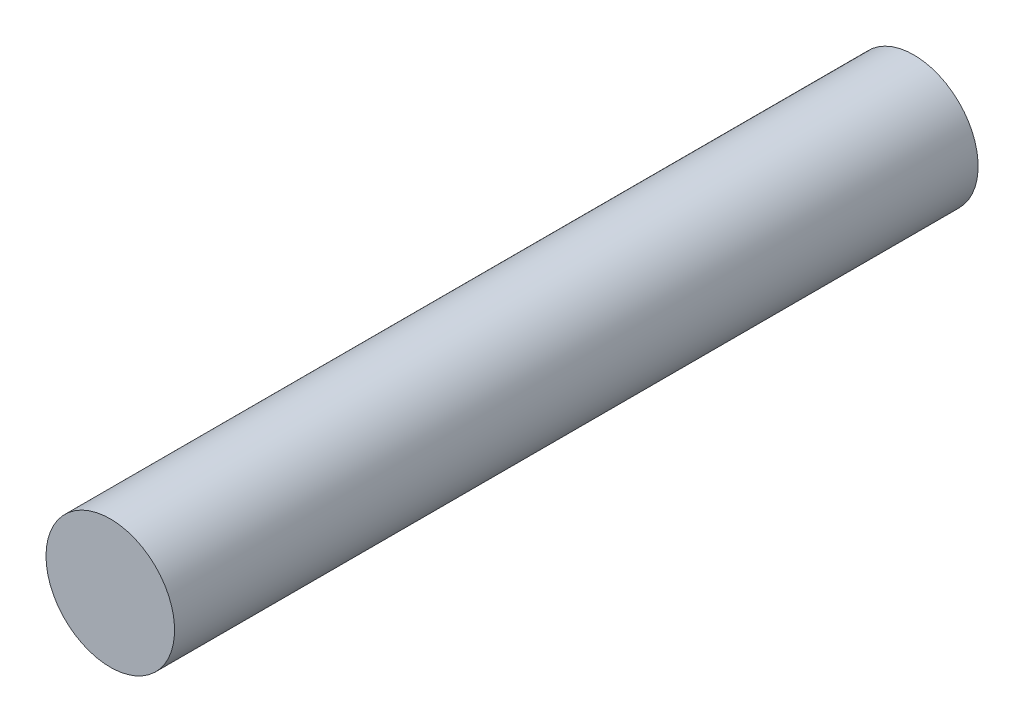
ISO-10303-21;
HEADER;
FILE_DESCRIPTION(('STEP AP214'),'2;1');
FILE_NAME('part.step','',(''),(''),'','','');
FILE_SCHEMA(('AUTOMOTIVE_DESIGN { 1 0 10303 214 1 1 1 1 }'));
ENDSEC;
DATA;
#1=APPLICATION_CONTEXT('core data for automotive mechanical design processes');
#2=APPLICATION_PROTOCOL_DEFINITION('international standard','automotive_design',2000,#1);
#3=PRODUCT_CONTEXT('',#1,'mechanical');
#4=PRODUCT('Part','Part','',(#3));
#5=PRODUCT_RELATED_PRODUCT_CATEGORY('part','',(#4));
#6=PRODUCT_DEFINITION_FORMATION('','',#4);
#7=PRODUCT_DEFINITION_CONTEXT('part definition',#1,'design');
#8=PRODUCT_DEFINITION('design','',#6,#7);
#9=PRODUCT_DEFINITION_SHAPE('','',#8);
#10=(LENGTH_UNIT() NAMED_UNIT(*) SI_UNIT(.MILLI.,.METRE.));
#11=(NAMED_UNIT(*) PLANE_ANGLE_UNIT() SI_UNIT($,.RADIAN.));
#12=(NAMED_UNIT(*) SI_UNIT($,.STERADIAN.) SOLID_ANGLE_UNIT());
#13=UNCERTAINTY_MEASURE_WITH_UNIT(LENGTH_MEASURE(1.E-05),#10,'distance_accuracy_value','');
#14=(GEOMETRIC_REPRESENTATION_CONTEXT(3) GLOBAL_UNCERTAINTY_ASSIGNED_CONTEXT((#13)) GLOBAL_UNIT_ASSIGNED_CONTEXT((#10,
#11,#12)) REPRESENTATION_CONTEXT('',''));
#15=CARTESIAN_POINT('',(0.,0.,0.));
#16=DIRECTION('',(0.,0.,1.));
#17=DIRECTION('',(1.,0.,0.));
#18=AXIS2_PLACEMENT_3D('',#15,#16,#17);
#19=CARTESIAN_POINT('',(0.,0.,0.));
#20=DIRECTION('',(0.,0.,1.));
#21=DIRECTION('',(1.,0.,0.));
#22=AXIS2_PLACEMENT_3D('',#19,#20,#21);
#23=CYLINDRICAL_SURFACE('',#22,4.);
#24=CARTESIAN_POINT('',(0.,0.,0.));
#25=DIRECTION('',(0.,0.,-1.));
#26=DIRECTION('',(-1.,0.,0.));
#27=AXIS2_PLACEMENT_3D('',#24,#25,#26);
#28=CIRCLE('',#27,4.);
#29=CARTESIAN_POINT('',(-4.,0.,0.));
#30=VERTEX_POINT('',#29);
#31=EDGE_CURVE('E8',#30,#30,#28,.T.);
#32=ORIENTED_EDGE('',*,*,#31,.F.);
#33=EDGE_LOOP('',(#32));
#34=FACE_BOUND('',#33,.T.);
#35=CARTESIAN_POINT('',(0.,0.,50.));
#36=DIRECTION('',(0.,0.,-1.));
#37=DIRECTION('',(-1.,0.,0.));
#38=AXIS2_PLACEMENT_3D('',#35,#36,#37);
#39=CIRCLE('',#38,4.);
#40=CARTESIAN_POINT('',(-4.,0.,50.));
#41=VERTEX_POINT('',#40);
#42=EDGE_CURVE('E15',#41,#41,#39,.T.);
#43=ORIENTED_EDGE('',*,*,#42,.T.);
#44=EDGE_LOOP('',(#43));
#45=FACE_BOUND('',#44,.T.);
#46=ADVANCED_FACE('F12',(#34,#45),#23,.T.);
#47=CARTESIAN_POINT('',(0.,0.,0.));
#48=DIRECTION('',(0.,0.,-1.));
#49=DIRECTION('',(-1.,0.,0.));
#50=AXIS2_PLACEMENT_3D('',#47,#48,#49);
#51=PLANE('',#50);
#52=ORIENTED_EDGE('',*,*,#31,.T.);
#53=EDGE_LOOP('',(#52));
#54=FACE_BOUND('',#53,.T.);
#55=ADVANCED_FACE('F27',(#54),#51,.T.);
#56=CARTESIAN_POINT('',(0.,0.,50.));
#57=DIRECTION('',(0.,0.,-1.));
#58=DIRECTION('',(-1.,0.,0.));
#59=AXIS2_PLACEMENT_3D('',#56,#57,#58);
#60=PLANE('',#59);
#61=ORIENTED_EDGE('',*,*,#42,.F.);
#62=EDGE_LOOP('',(#61));
#63=FACE_BOUND('',#62,.T.);
#64=ADVANCED_FACE('F25',(#63),#60,.F.);
#65=CLOSED_SHELL('',(#46,#55,#64));
#66=MANIFOLD_SOLID_BREP('B1',#65);
#67=ADVANCED_BREP_SHAPE_REPRESENTATION('',(#18,#66),#14);
#68=SHAPE_DEFINITION_REPRESENTATION(#9,#67);
ENDSEC;
END-ISO-10303-21;
